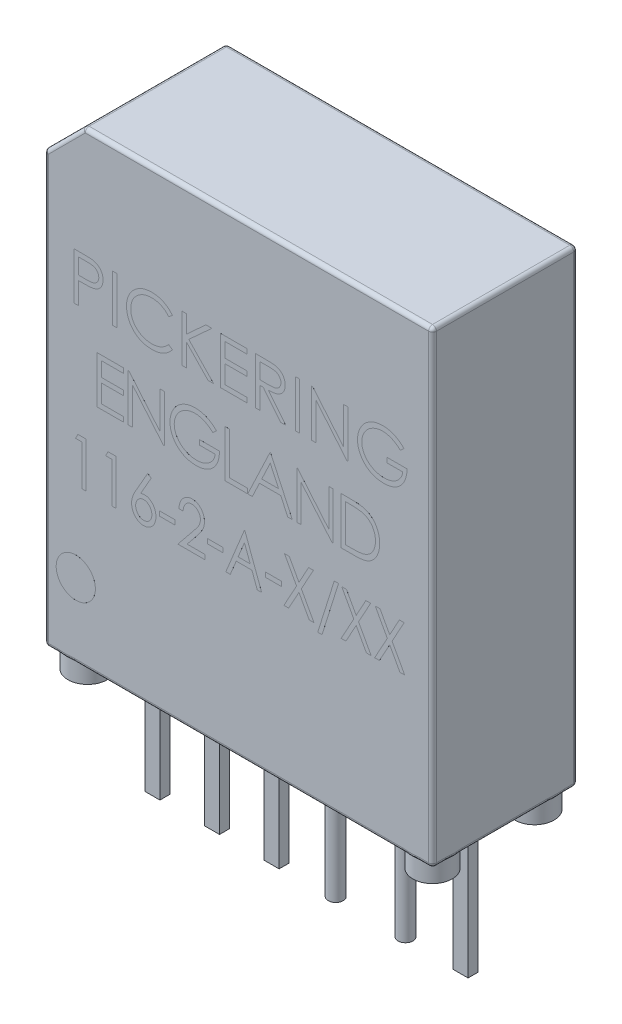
from build123d import *

# Parameters (mm, degrees)
SKETCH1_W           = 9.9
SKETCH1_H           = 3.7
MAIN_BODY_DEPTH     = 11.942
BOX_STYLE_CUT_DEPTH = 14.446332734
SKETCH3_R           = 0.5
FEET_DEPTH          = 0.508
SKETCH4_R           = 0.1905
SKETCH4_W           = 0.381
SKETCH4_H           = 0.254
PINS_DEPTH          = 3.678
SKETCH5_R           = 0.5
SKETCH5_W           = 0.107692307
SKETCH5_H           = 1.2
SKETCH5_W_2         = 0.107692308
SKETCH5_W_3         = 0.398076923
SKETCH5_H_2         = 0.117948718
LETTERING_DEPTH     = 0.0001
FILLET2_R           = 0.1


with BuildPart() as part:
    # Sketch1 → Main body (new body)
    with BuildSketch(Plane(origin=(0, 0, 0), x_dir=(1, 0, 0), z_dir=(0, 1, 0))):
        Rectangle(SKETCH1_W, SKETCH1_H)
    extrude(amount=MAIN_BODY_DEPTH)

    # Sketch2 → Box style cut (cut, through all)
    with BuildSketch(Plane.XY.offset(1.85)):
        Polygon((-3.95, 11.942), (-4.95, 10.942), (-4.95, 11.942), align=None)
    extrude(amount=-BOX_STYLE_CUT_DEPTH, mode=Mode.SUBTRACT)

    # Sketch3 → Feet (add)
    with BuildSketch(Plane.XZ):
        with Locations(Location((-4.4, 1.3, 0), (0, 0, 90))):
            Circle(SKETCH3_R)
        with Locations(Location((-4.4, -1.3, 0), (0, 0, 90))):
            Circle(SKETCH3_R)
        with Locations(Location((4.4, -1.3, 0), (0, 0, 90))):
            Circle(SKETCH3_R)
        with Locations(Location((4.4, 1.3, 0), (0, 0, 90))):
            Circle(SKETCH3_R)
    extrude(amount=FEET_DEPTH)

    # Sketch4 → Pins (add)
    with BuildSketch(Plane.XZ):
        with Locations(Location((2.41, 0, 0), (0, 0, 90))):
            Circle(SKETCH4_R)
        with Locations(Location((0.63, 0, 0), (0, 0, 90))):
            Circle(SKETCH4_R)
        with Locations((-3.93, -0.013013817)):
            Rectangle(SKETCH4_W, SKETCH4_H)
        with Locations((-2.41, -0.013013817)):
            Rectangle(SKETCH4_W, SKETCH4_H)
        with Locations((-0.89, -0.013013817)):
            Rectangle(SKETCH4_W, SKETCH4_H)
        with Locations((3.93, -0.013013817)):
            Rectangle(SKETCH4_W, SKETCH4_H)
    extrude(amount=PINS_DEPTH)

    # Sketch5 → Lettering (add)
    # profile 1 of 29: a face of its own
    with BuildSketch(Plane.XY.offset(1.85)):
        with Locations(Location((-4.15, 1.9, 0), (0, 0, 180))):
            Circle(SKETCH5_R)
    # profile 2 of 29: a face of its own
    with BuildSketch(Plane.XY.offset(1.85)):
        with BuildLine():
            Line((-4.193510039, 9.142), (-3.958173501, 9.142))
            add(Edge.make_bspline(
                [(-3.958173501, 9.142), (-3.941986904, 9.141982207), (-3.910972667, 9.141948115), (-3.866498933, 9.140914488), (-3.826107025, 9.139533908), (-3.789884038, 9.137620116), (-3.757718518, 9.135358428), (-3.729756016, 9.1321863), (-3.705776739, 9.128874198), (-3.691408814, 9.125506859), (-3.684856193, 9.123971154)],
                knots=[0, 0, 0, 0, 1.415646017, 2.712440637, 3.8905458, 4.950247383, 5.884950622, 6.709939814, 7.411656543, 8, 8, 8, 8], degree=3))
            add(Edge.make_bspline(
                [(-3.684856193, 9.123971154), (-3.676561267, 9.121700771), (-3.660166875, 9.117213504), (-3.63654366, 9.108225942), (-3.614068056, 9.097569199), (-3.59266295, 9.085423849), (-3.572591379, 9.071268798), (-3.553553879, 9.055677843), (-3.535718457, 9.03829102), (-3.519185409, 9.019303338), (-3.504002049, 8.999033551), (-3.490929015, 8.977179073), (-3.479982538, 8.954107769), (-3.470593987, 8.929835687), (-3.463836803, 8.904159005), (-3.458746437, 8.877256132), (-3.455515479, 8.849129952), (-3.45520603, 8.829909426), (-3.455048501, 8.820125)],
                knots=[0, 0, 0, 0, 0.999701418, 1.975846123, 2.934577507, 3.890451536, 4.834027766, 5.787354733, 6.749476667, 7.726910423, 8.712836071, 9.690891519, 10.682875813, 11.679750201, 12.712814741, 13.765529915, 14.8625177, 16, 16, 16, 16], degree=3))
            add(Edge.make_bspline(
                [(-3.455048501, 8.820125), (-3.455192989, 8.810258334), (-3.455475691, 8.790953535), (-3.458868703, 8.762711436), (-3.463439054, 8.735722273), (-3.470466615, 8.71004589), (-3.479670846, 8.685834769), (-3.490468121, 8.662718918), (-3.503491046, 8.641091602), (-3.518454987, 8.620874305), (-3.535101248, 8.602048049), (-3.553359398, 8.584749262), (-3.573155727, 8.569079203), (-3.594427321, 8.555002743), (-3.617381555, 8.542846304), (-3.641670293, 8.531958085), (-3.667504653, 8.522813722), (-3.685382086, 8.518003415), (-3.694471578, 8.515557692)],
                knots=[0, 0, 0, 0, 1.121902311, 2.195077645, 3.232258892, 4.234102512, 5.217864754, 6.176164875, 7.132989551, 8.084763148, 9.034132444, 9.988522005, 10.94243251, 11.903244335, 12.886203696, 13.894208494, 14.929344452, 16, 16, 16, 16], degree=3))
            add(Edge.make_bspline(
                [(-3.694471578, 8.515557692), (-3.701989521, 8.513958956), (-3.71846553, 8.510455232), (-3.745600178, 8.506543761), (-3.777192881, 8.503205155), (-3.81320052, 8.500701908), (-3.853590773, 8.498558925), (-3.89838549, 8.496855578), (-3.947672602, 8.495919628), (-3.982051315, 8.495871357), (-4.000000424, 8.495846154)],
                knots=[0, 0, 0, 0, 0.601384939, 1.31797006, 2.144135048, 3.087295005, 4.142315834, 5.309527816, 6.595305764, 8, 8, 8, 8], degree=3))
            Line((-4.000000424, 8.495846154), (-4.085817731, 8.495846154))
            Line((-4.085817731, 8.495846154), (-4.085817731, 7.942))
            Line((-4.085817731, 7.942), (-4.193510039, 7.942))
            Line((-4.193510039, 7.942), (-4.193510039, 9.142))
        make_face()
        with BuildLine():
            Line((-4.085817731, 9.018923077), (-4.085817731, 8.618923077))
            Line((-4.085817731, 8.618923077), (-3.875721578, 8.616278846))
            add(Edge.make_bspline(
                [(-3.875721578, 8.616278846), (-3.865463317, 8.616273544), (-3.845659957, 8.616263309), (-3.817053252, 8.617629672), (-3.790512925, 8.619206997), (-3.766120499, 8.621516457), (-3.743864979, 8.624780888), (-3.723709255, 8.628076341), (-3.705809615, 8.632843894), (-3.684861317, 8.639263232), (-3.661518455, 8.650211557), (-3.636123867, 8.666102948), (-3.614602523, 8.686359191), (-3.595979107, 8.709134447), (-3.581199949, 8.734471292), (-3.570380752, 8.761580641), (-3.564023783, 8.790184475), (-3.563171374, 8.809757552), (-3.562740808, 8.819644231)],
                knots=[0, 0, 0, 0, 1.160613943, 2.240541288, 3.23993089, 4.169200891, 5.011653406, 5.7853311, 6.478053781, 7.106038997, 8.262395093, 9.384106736, 10.481365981, 11.59014053, 12.70357646, 13.786202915, 14.881775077, 16, 16, 16, 16], degree=3))
            add(Edge.make_bspline(
                [(-3.562740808, 8.819644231), (-3.563173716, 8.829291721), (-3.564034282, 8.848469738), (-3.570430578, 8.876576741), (-3.581178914, 8.903400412), (-3.596078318, 8.928419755), (-3.614160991, 8.951113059), (-3.635177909, 8.97082636), (-3.659079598, 8.986673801), (-3.681313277, 8.996902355), (-3.701062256, 9.003147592), (-3.71821607, 9.007517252), (-3.737584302, 9.011006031), (-3.759173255, 9.013831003), (-3.782815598, 9.016249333), (-3.808714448, 9.017890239), (-3.836771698, 9.018850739), (-3.856249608, 9.01889838), (-3.866346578, 9.018923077)],
                knots=[0, 0, 0, 0, 1.120700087, 2.227813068, 3.331159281, 4.466773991, 5.599788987, 6.693661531, 7.80175334, 8.91857717, 9.525282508, 10.207424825, 10.974604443, 11.810962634, 12.737642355, 13.736264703, 14.826523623, 16, 16, 16, 16], degree=3))
            Line((-3.866346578, 9.018923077), (-4.085817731, 9.018923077))
        make_face(mode=Mode.SUBTRACT)
    # profile 3 of 29: a face of its own
    with BuildSketch(Plane.XY.offset(1.85)):
        with Locations((-3.155048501, 8.542)):
            Rectangle(SKETCH5_W, SKETCH5_H)
    # profile 4 of 29: a face of its own
    with BuildSketch(Plane.XY.offset(1.85)):
        with BuildLine():
            Line((-1.685817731, 8.921807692), (-1.780048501, 8.849692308))
            add(Edge.make_bspline(
                [(-1.780048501, 8.849692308), (-1.786770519, 8.857703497), (-1.80012393, 8.873617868), (-1.821607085, 8.895965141), (-1.84399622, 8.916901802), (-1.867282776, 8.936527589), (-1.891885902, 8.954156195), (-1.917209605, 8.970706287), (-1.943677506, 8.98554094), (-1.980278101, 9.00352825), (-2.028157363, 9.02229836), (-2.088429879, 9.038036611), (-2.15134797, 9.048055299), (-2.194272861, 9.049140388), (-2.216106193, 9.049692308)],
                knots=[0, 0, 0, 0, 0.757959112, 1.505699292, 2.245454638, 2.979532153, 3.711538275, 4.438200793, 5.171680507, 5.909471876, 7.393775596, 8.890124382, 10.418191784, 12, 12, 12, 12], degree=3))
            add(Edge.make_bspline(
                [(-2.216106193, 9.049692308), (-2.228134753, 9.049553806), (-2.252080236, 9.049278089), (-2.287616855, 9.045640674), (-2.322489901, 9.04052826), (-2.35667669, 9.032942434), (-2.390133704, 9.023351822), (-2.423079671, 9.01189168), (-2.455037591, 8.997712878), (-2.486449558, 8.982041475), (-2.516545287, 8.964340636), (-2.545021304, 8.945033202), (-2.57177375, 8.924335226), (-2.596823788, 8.902169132), (-2.620197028, 8.878634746), (-2.641724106, 8.853481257), (-2.661330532, 8.826789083), (-2.679404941, 8.798910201), (-2.695592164, 8.769925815), (-2.709145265, 8.739728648), (-2.721147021, 8.708835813), (-2.730643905, 8.676898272), (-2.738160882, 8.644140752), (-2.743347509, 8.610475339), (-2.746943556, 8.575972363), (-2.747217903, 8.552586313), (-2.747356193, 8.540798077)],
                knots=[0, 0, 0, 0, 1.054917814, 2.100044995, 3.131103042, 4.146048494, 5.169673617, 6.183595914, 7.203665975, 8.234915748, 9.262203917, 10.264457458, 11.251630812, 12.227803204, 13.197192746, 14.159520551, 15.12972552, 16.100847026, 17.073214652, 18.039054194, 19.002613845, 19.979014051, 20.95965708, 21.949030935, 22.966165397, 24, 24, 24, 24], degree=3))
            add(Edge.make_bspline(
                [(-2.747356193, 8.540798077), (-2.746923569, 8.523061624), (-2.74607417, 8.488238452), (-2.738514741, 8.437231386), (-2.727027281, 8.388367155), (-2.709810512, 8.341951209), (-2.688581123, 8.297411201), (-2.661755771, 8.255500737), (-2.630687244, 8.215586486), (-2.594936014, 8.178611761), (-2.555711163, 8.144835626), (-2.513626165, 8.11509257), (-2.468785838, 8.090298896), (-2.421685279, 8.069667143), (-2.37196204, 8.053807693), (-2.319705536, 8.042642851), (-2.265029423, 8.035359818), (-2.227668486, 8.034662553), (-2.20865427, 8.034307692)],
                knots=[0, 0, 0, 0, 1.029171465, 2.020641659, 2.987623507, 3.938342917, 4.889210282, 5.84687017, 6.821220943, 7.821438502, 8.827599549, 9.822697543, 10.807740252, 11.797342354, 12.80366471, 13.83203677, 14.896651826, 16, 16, 16, 16], degree=3))
            add(Edge.make_bspline(
                [(-2.20865427, 8.034307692), (-2.187704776, 8.034886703), (-2.146471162, 8.036026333), (-2.086002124, 8.045680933), (-2.028115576, 8.061335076), (-1.972808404, 8.083242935), (-1.920236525, 8.111722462), (-1.87031767, 8.146247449), (-1.823009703, 8.187146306), (-1.794562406, 8.218374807), (-1.780048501, 8.234307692)],
                knots=[0, 0, 0, 0, 1.028121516, 2.023589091, 2.998037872, 3.967518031, 4.937445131, 5.927275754, 6.942489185, 8, 8, 8, 8], degree=3))
            Line((-1.780048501, 8.234307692), (-1.685817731, 8.162913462))
            add(Edge.make_bspline(
                [(-1.685817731, 8.162913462), (-1.693401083, 8.153128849), (-1.708531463, 8.133606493), (-1.733031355, 8.106084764), (-1.758840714, 8.080197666), (-1.786151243, 8.05615391), (-1.814648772, 8.033472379), (-1.844844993, 8.012797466), (-1.876342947, 7.993840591), (-1.909035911, 7.976482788), (-1.94288915, 7.961082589), (-1.977862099, 7.94789844), (-2.013804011, 7.936541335), (-2.050716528, 7.927197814), (-2.088676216, 7.919904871), (-2.127546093, 7.915029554), (-2.16741005, 7.911689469), (-2.194304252, 7.911385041), (-2.207933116, 7.911230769)],
                knots=[0, 0, 0, 0, 0.986787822, 1.968848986, 2.935600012, 3.899624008, 4.868462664, 5.837806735, 6.815139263, 7.798259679, 8.787526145, 9.778297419, 10.776456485, 11.791383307, 12.812564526, 13.85620153, 14.913611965, 16, 16, 16, 16], degree=3))
            add(Edge.make_bspline(
                [(-2.207933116, 7.911230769), (-2.220839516, 7.911320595), (-2.246360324, 7.911498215), (-2.284039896, 7.91437553), (-2.320722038, 7.918301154), (-2.35630191, 7.924212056), (-2.390973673, 7.931187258), (-2.424423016, 7.940537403), (-2.456979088, 7.951011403), (-2.488511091, 7.963321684), (-2.519045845, 7.977212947), (-2.548484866, 7.99291291), (-2.576814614, 8.010289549), (-2.604313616, 8.028959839), (-2.630575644, 8.049523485), (-2.655828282, 8.071694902), (-2.680213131, 8.095399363), (-2.695299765, 8.112492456), (-2.702885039, 8.121086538)],
                knots=[0, 0, 0, 0, 1.114604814, 2.203992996, 3.262667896, 4.300477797, 5.318619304, 6.316056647, 7.298880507, 8.271930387, 9.238335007, 10.195173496, 11.151986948, 12.108099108, 13.064862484, 14.031167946, 15.010108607, 16, 16, 16, 16], degree=3))
            add(Edge.make_bspline(
                [(-2.702885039, 8.121086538), (-2.715034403, 8.136014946), (-2.739186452, 8.165691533), (-2.770086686, 8.213789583), (-2.796537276, 8.264007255), (-2.817923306, 8.316608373), (-2.834641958, 8.371474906), (-2.846224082, 8.428634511), (-2.853750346, 8.488033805), (-2.854611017, 8.52843499), (-2.855048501, 8.548971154)],
                knots=[0, 0, 0, 0, 0.994628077, 1.977248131, 2.950237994, 3.925870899, 4.908910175, 5.911660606, 6.938484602, 8, 8, 8, 8], degree=3))
            add(Edge.make_bspline(
                [(-2.855048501, 8.548971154), (-2.854515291, 8.570555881), (-2.853466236, 8.613022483), (-2.844553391, 8.675344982), (-2.830215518, 8.735054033), (-2.809850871, 8.792038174), (-2.784031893, 8.846597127), (-2.752137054, 8.898314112), (-2.714536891, 8.947519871), (-2.671526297, 8.993467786), (-2.624360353, 9.035481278), (-2.573851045, 9.072443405), (-2.520097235, 9.103203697), (-2.463691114, 9.128916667), (-2.404210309, 9.148680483), (-2.341781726, 9.162515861), (-2.276522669, 9.171127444), (-2.231998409, 9.172216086), (-2.209375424, 9.172769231)],
                knots=[0, 0, 0, 0, 1.032925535, 2.032216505, 3.007276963, 3.968222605, 4.92396291, 5.891752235, 6.871517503, 7.883894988, 8.900124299, 9.891468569, 10.874487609, 11.85992873, 12.854644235, 13.869047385, 14.917252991, 16, 16, 16, 16], degree=3))
            add(Edge.make_bspline(
                [(-2.209375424, 9.172769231), (-2.195587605, 9.172603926), (-2.168296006, 9.172276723), (-2.127923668, 9.169086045), (-2.088617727, 9.163767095), (-2.050351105, 9.156527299), (-2.012937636, 9.147541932), (-1.976663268, 9.135836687), (-1.941315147, 9.122452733), (-1.907116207, 9.107038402), (-1.874230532, 9.089735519), (-1.842668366, 9.070735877), (-1.812680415, 9.050063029), (-1.784055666, 9.027892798), (-1.757272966, 9.003756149), (-1.731571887, 8.978316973), (-1.707825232, 8.950842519), (-1.693166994, 8.931503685), (-1.685817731, 8.921807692)],
                knots=[0, 0, 0, 0, 1.096760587, 2.17092713, 3.219439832, 4.250915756, 5.268269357, 6.278326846, 7.281116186, 8.274029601, 9.260640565, 10.235837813, 11.203064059, 12.156899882, 13.114053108, 14.069676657, 15.032185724, 16, 16, 16, 16], degree=3))
        make_face()
    # profile 5 of 29: a face of its own
    with BuildSketch(Plane.XY.offset(1.85)):
        Polygon((-1.439663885, 9.142), (-1.331971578, 9.142), (-1.331971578, 8.685028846), (-0.831731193, 9.142), (-0.678125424, 9.142), (-1.267788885, 8.603538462), (-0.631971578, 7.942), (-0.775481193, 7.942), (-1.331971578, 8.521086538), (-1.331971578, 7.942), (-1.439663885, 7.942), align=None)
    # profile 6 of 29: a face of its own
    with BuildSketch(Plane.XY.offset(1.85)):
        Polygon((-0.455048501, 9.142), (0.221874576, 9.142), (0.221874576, 9.018923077), (-0.347356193, 9.018923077), (-0.347356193, 8.649692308), (0.221874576, 8.649692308), (0.221874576, 8.526615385), (-0.347356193, 8.526615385), (-0.347356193, 8.065076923), (0.221874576, 8.065076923), (0.221874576, 7.942), (-0.455048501, 7.942), align=None)
    # profile 7 of 29: a face of its own
    with BuildSketch(Plane.XY.offset(1.85)):
        with BuildLine():
            Line((0.437259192, 9.142), (0.677403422, 9.142))
            add(Edge.make_bspline(
                [(0.677403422, 9.142), (0.693428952, 9.141946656), (0.724199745, 9.14184423), (0.768282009, 9.141273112), (0.808337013, 9.13963619), (0.844343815, 9.138227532), (0.876301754, 9.135658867), (0.904308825, 9.133203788), (0.928236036, 9.129989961), (0.942720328, 9.127005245), (0.949278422, 9.125653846)],
                knots=[0, 0, 0, 0, 1.410062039, 2.707475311, 3.878576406, 4.937260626, 5.877586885, 6.699081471, 7.410979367, 8, 8, 8, 8], degree=3))
            add(Edge.make_bspline(
                [(0.949278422, 9.125653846), (0.958057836, 9.123484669), (0.975429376, 9.11919259), (1.000440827, 9.110120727), (1.024274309, 9.09962257), (1.046830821, 9.087292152), (1.067997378, 9.073037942), (1.087992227, 9.057106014), (1.1069061, 9.039583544), (1.123974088, 9.020028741), (1.140067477, 8.999513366), (1.15364072, 8.977329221), (1.165341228, 8.954130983), (1.174656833, 8.929682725), (1.182157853, 8.904221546), (1.187446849, 8.877516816), (1.190618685, 8.849690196), (1.190941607, 8.830710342), (1.191105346, 8.821086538)],
                knots=[0, 0, 0, 0, 1.027469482, 2.033020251, 3.019912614, 3.986113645, 4.951240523, 5.91722682, 6.890402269, 7.87763091, 8.8651537, 9.85103654, 10.82876324, 11.815024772, 12.821070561, 13.842952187, 14.906261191, 16, 16, 16, 16], degree=3))
            add(Edge.make_bspline(
                [(1.191105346, 8.821086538), (1.190601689, 8.80509736), (1.189618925, 8.773898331), (1.180456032, 8.728620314), (1.16544694, 8.686383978), (1.144764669, 8.647242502), (1.118426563, 8.611958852), (1.086772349, 8.580967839), (1.049784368, 8.555034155), (1.01535146, 8.537050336), (0.984935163, 8.525532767), (0.95989517, 8.517428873), (0.932580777, 8.511167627), (0.903253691, 8.505558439), (0.871791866, 8.501323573), (0.83827071, 8.498221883), (0.802666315, 8.496283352), (0.778207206, 8.495994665), (0.765624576, 8.495846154)],
                knots=[0, 0, 0, 0, 1.260483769, 2.459530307, 3.627416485, 4.787058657, 5.939039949, 7.08810263, 8.267026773, 9.491475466, 10.141966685, 10.831826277, 11.566392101, 12.351337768, 13.187381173, 14.07005841, 15.007169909, 16, 16, 16, 16], degree=3))
            Line((0.765624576, 8.495846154), (1.206489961, 7.942))
            Line((1.206489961, 7.942), (1.073316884, 7.942))
            Line((1.073316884, 7.942), (0.632451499, 8.495846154))
            Line((0.632451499, 8.495846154), (0.544951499, 8.495846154))
            Line((0.544951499, 8.495846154), (0.544951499, 7.942))
            Line((0.544951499, 7.942), (0.437259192, 7.942))
            Line((0.437259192, 7.942), (0.437259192, 9.142))
        make_face()
        with BuildLine():
            Line((0.544951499, 9.018923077), (0.544951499, 8.618923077))
            Line((0.544951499, 8.618923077), (0.764663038, 8.617240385))
            add(Edge.make_bspline(
                [(0.764663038, 8.617240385), (0.774921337, 8.617235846), (0.794804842, 8.61722705), (0.823570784, 8.618596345), (0.850354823, 8.620154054), (0.875054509, 8.622536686), (0.897680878, 8.62560734), (0.91822262, 8.629448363), (0.936713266, 8.633923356), (0.958278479, 8.640849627), (0.982359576, 8.651823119), (1.008530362, 8.667788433), (1.030816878, 8.687869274), (1.049645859, 8.710831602), (1.06477595, 8.736078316), (1.07544294, 8.763306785), (1.082211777, 8.791829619), (1.083010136, 8.811433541), (1.083413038, 8.821326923)],
                knots=[0, 0, 0, 0, 1.146690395, 2.22261258, 3.21895312, 4.145990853, 4.996080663, 5.770904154, 6.481378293, 7.121626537, 8.300444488, 9.431385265, 10.535395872, 11.636531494, 12.74115979, 13.810798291, 14.895190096, 16, 16, 16, 16], degree=3))
            add(Edge.make_bspline(
                [(1.083413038, 8.821326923), (1.083000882, 8.830977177), (1.08218414, 8.850100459), (1.07551599, 8.878096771), (1.064239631, 8.904519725), (1.049043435, 8.929261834), (1.030529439, 8.951720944), (1.008820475, 8.970937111), (0.984510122, 8.98679407), (0.961788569, 8.996927), (0.941479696, 9.003139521), (0.923846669, 9.007511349), (0.903922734, 9.011023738), (0.881611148, 9.013837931), (0.857007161, 9.016256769), (0.829986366, 9.01788595), (0.800728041, 9.018850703), (0.780449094, 9.018898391), (0.769951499, 9.018923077)],
                knots=[0, 0, 0, 0, 1.101028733, 2.181837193, 3.264309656, 4.369019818, 5.486613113, 6.575447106, 7.666700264, 8.788928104, 9.402425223, 10.0903467, 10.862060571, 11.710948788, 12.657782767, 13.684531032, 14.801375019, 16, 16, 16, 16], degree=3))
            Line((0.769951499, 9.018923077), (0.544951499, 9.018923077))
        make_face(mode=Mode.SUBTRACT)
    # profile 8 of 29: a face of its own
    with BuildSketch(Plane.XY.offset(1.85)):
        with Locations((1.506489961, 8.542)):
            Rectangle(SKETCH5_W_2, SKETCH5_H)
    # profile 9 of 29: a face of its own
    with BuildSketch(Plane.XY.offset(1.85)):
        Polygon((1.868028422, 7.942), (1.868028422, 9.142), (1.890624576, 9.142), (2.683413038, 8.197528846), (2.683413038, 9.142), (2.791105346, 9.142), (2.791105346, 7.942), (2.766586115, 7.942), (1.97572073, 8.884307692), (1.97572073, 7.942), align=None)
    # profile 10 of 29: a face of its own
    with BuildSketch(Plane.XY.offset(1.85)):
        with BuildLine():
            Line((4.221874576, 8.937192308), (4.129566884, 8.849692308))
            add(Edge.make_bspline(
                [(4.129566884, 8.849692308), (4.112863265, 8.865405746), (4.079854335, 8.896457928), (4.026039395, 8.936747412), (3.969891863, 8.971261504), (3.911704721, 8.999343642), (3.852918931, 9.021750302), (3.794314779, 9.037702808), (3.736493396, 9.047876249), (3.698036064, 9.049092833), (3.679086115, 9.049692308)],
                knots=[0, 0, 0, 0, 1.08915593, 2.152340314, 3.188132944, 4.216796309, 5.218260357, 6.173443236, 7.099959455, 8, 8, 8, 8], degree=3))
            add(Edge.make_bspline(
                [(3.679086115, 9.049692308), (3.667458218, 9.0495505), (3.644232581, 9.049267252), (3.609733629, 9.045652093), (3.575596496, 9.040452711), (3.541885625, 9.032929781), (3.508535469, 9.023395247), (3.475662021, 9.011468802), (3.443203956, 8.997564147), (3.411467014, 8.981497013), (3.380698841, 8.96384678), (3.351639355, 8.94428728), (3.324103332, 8.92344541), (3.298608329, 8.900799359), (3.275007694, 8.876554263), (3.252739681, 8.851161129), (3.232587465, 8.823926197), (3.21438478, 8.795350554), (3.198146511, 8.765936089), (3.183812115, 8.735965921), (3.171778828, 8.705539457), (3.162257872, 8.674618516), (3.15440279, 8.643442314), (3.148876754, 8.611794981), (3.145761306, 8.579642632), (3.14522241, 8.558112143), (3.144951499, 8.547288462)],
                knots=[0, 0, 0, 0, 1.02818874, 2.053710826, 3.065248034, 4.081641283, 5.106893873, 6.131558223, 7.173050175, 8.228653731, 9.27666206, 10.308777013, 11.325269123, 12.329503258, 13.32196095, 14.316845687, 15.314881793, 16.315733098, 17.311955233, 18.285320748, 19.252783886, 20.203351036, 21.145449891, 22.095197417, 23.042428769, 24, 24, 24, 24], degree=3))
            add(Edge.make_bspline(
                [(3.144951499, 8.547288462), (3.145210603, 8.536224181), (3.145728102, 8.514125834), (3.149040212, 8.481145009), (3.155187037, 8.448654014), (3.163404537, 8.416546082), (3.173683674, 8.384766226), (3.186497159, 8.353452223), (3.201673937, 8.322605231), (3.219240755, 8.292503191), (3.238504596, 8.263181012), (3.260085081, 8.235560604), (3.283008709, 8.209274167), (3.308110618, 8.184905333), (3.334585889, 8.161802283), (3.363225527, 8.140601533), (3.393466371, 8.120894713), (3.425354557, 8.102930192), (3.458544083, 8.086881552), (3.49257497, 8.072610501), (3.527555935, 8.060857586), (3.563303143, 8.051278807), (3.599773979, 8.043427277), (3.637153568, 8.038376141), (3.675167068, 8.034710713), (3.700791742, 8.034442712), (3.713701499, 8.034307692)],
                knots=[0, 0, 0, 0, 0.93586088, 1.869166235, 2.799637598, 3.729985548, 4.670839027, 5.622275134, 6.589130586, 7.576015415, 8.568469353, 9.55398029, 10.53834874, 11.515998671, 12.510579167, 13.508179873, 14.527009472, 15.561807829, 16.601455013, 17.643573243, 18.680854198, 19.719860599, 20.772568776, 21.833555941, 22.908541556, 24, 24, 24, 24], degree=3))
            add(Edge.make_bspline(
                [(3.713701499, 8.034307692), (3.72925979, 8.034632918), (3.759811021, 8.035271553), (3.804720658, 8.040243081), (3.84785314, 8.048007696), (3.889087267, 8.05937886), (3.928470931, 8.073882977), (3.966148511, 8.09136711), (4.001823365, 8.112501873), (4.035602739, 8.13635577), (4.066719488, 8.162932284), (4.094783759, 8.191610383), (4.119347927, 8.222250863), (4.14077811, 8.254673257), (4.158506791, 8.289145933), (4.173058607, 8.325499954), (4.184212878, 8.363751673), (4.188791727, 8.390183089), (4.191105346, 8.403538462)],
                knots=[0, 0, 0, 0, 1.13008108, 2.219097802, 3.278683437, 4.311054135, 5.322181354, 6.324827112, 7.324222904, 8.330512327, 9.32562643, 10.293043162, 11.24128371, 12.174520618, 13.111833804, 14.052305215, 15.015860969, 16, 16, 16, 16], degree=3))
            Line((4.191105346, 8.403538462), (3.791105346, 8.403538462))
            Line((3.791105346, 8.403538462), (3.791105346, 8.526615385))
            Line((3.791105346, 8.526615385), (4.298797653, 8.526615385))
            add(Edge.make_bspline(
                [(4.298797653, 8.526615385), (4.298212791, 8.503675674), (4.29706811, 8.458778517), (4.289038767, 8.393302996), (4.276073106, 8.331461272), (4.258360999, 8.273188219), (4.235432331, 8.218566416), (4.207533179, 8.167540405), (4.174217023, 8.120439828), (4.136670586, 8.07688017), (4.094533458, 8.03802444), (4.048944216, 8.003873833), (3.999827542, 7.975107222), (3.947229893, 7.951703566), (3.891323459, 7.933438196), (3.831978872, 7.920487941), (3.769276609, 7.912729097), (3.726304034, 7.911737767), (3.704326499, 7.911230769)],
                knots=[0, 0, 0, 0, 1.140356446, 2.231883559, 3.274166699, 4.278491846, 5.25512956, 6.21435461, 7.1637429, 8.11826594, 9.068280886, 10.0076534, 10.945064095, 11.891975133, 12.864533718, 13.863980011, 14.907571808, 16, 16, 16, 16], degree=3))
            add(Edge.make_bspline(
                [(3.704326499, 7.911230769), (3.690780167, 7.911425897), (3.664062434, 7.91181075), (3.624602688, 7.914545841), (3.586230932, 7.918756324), (3.548952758, 7.925114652), (3.51263104, 7.932902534), (3.477447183, 7.942875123), (3.443267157, 7.954418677), (3.410038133, 7.967548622), (3.378061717, 7.982761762), (3.347195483, 7.999667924), (3.317268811, 8.018179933), (3.288485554, 8.038617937), (3.260695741, 8.060829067), (3.234078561, 8.084857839), (3.208485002, 8.110630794), (3.192452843, 8.128932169), (3.184374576, 8.138153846)],
                knots=[0, 0, 0, 0, 1.107784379, 2.184907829, 3.233506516, 4.263428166, 5.276301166, 6.270063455, 7.25232949, 8.225834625, 9.190232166, 10.146266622, 11.1027726, 12.066435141, 13.031522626, 14.010570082, 14.99756817, 16, 16, 16, 16], degree=3))
            add(Edge.make_bspline(
                [(3.184374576, 8.138153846), (3.172653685, 8.152783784), (3.149406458, 8.181800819), (3.119482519, 8.228292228), (3.093973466, 8.276430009), (3.073275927, 8.326348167), (3.057114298, 8.378000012), (3.045523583, 8.43131954), (3.038732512, 8.486375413), (3.037754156, 8.523632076), (3.037259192, 8.542480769)],
                knots=[0, 0, 0, 0, 1.023165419, 2.029347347, 3.013907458, 3.994755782, 4.975994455, 5.96558838, 6.970761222, 8, 8, 8, 8], degree=3))
            add(Edge.make_bspline(
                [(3.037259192, 8.542480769), (3.037441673, 8.556594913), (3.037804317, 8.584643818), (3.042201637, 8.626286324), (3.048510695, 8.667189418), (3.057783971, 8.707319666), (3.069474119, 8.746703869), (3.084063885, 8.785360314), (3.101050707, 8.823311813), (3.120794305, 8.860297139), (3.14276612, 8.895825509), (3.16661191, 8.929753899), (3.192670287, 8.961464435), (3.220515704, 8.991358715), (3.250480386, 9.019061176), (3.282283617, 9.0448283), (3.315949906, 9.06869465), (3.351585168, 9.090284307), (3.388657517, 9.109677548), (3.427078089, 9.126679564), (3.466835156, 9.140730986), (3.507630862, 9.152653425), (3.549774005, 9.161470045), (3.592958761, 9.1678639), (3.637410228, 9.172238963), (3.667456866, 9.172590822), (3.682691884, 9.172769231)],
                knots=[0, 0, 0, 0, 1.008945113, 2.00506715, 2.99143336, 3.967273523, 4.948097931, 5.927297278, 6.919902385, 7.919676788, 8.923139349, 9.905703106, 10.883022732, 11.856032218, 12.825136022, 13.798837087, 14.781400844, 15.773989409, 16.776158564, 17.77167057, 18.775803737, 19.789618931, 20.80898985, 21.851988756, 22.910860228, 24, 24, 24, 24], degree=3))
            add(Edge.make_bspline(
                [(3.682691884, 9.172769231), (3.695116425, 9.172570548), (3.719752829, 9.172176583), (3.75641308, 9.169445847), (3.792506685, 9.165117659), (3.828087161, 9.159211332), (3.863033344, 9.151166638), (3.897444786, 9.141539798), (3.93137137, 9.130331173), (3.96470677, 9.116963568), (3.997675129, 9.101790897), (4.03045976, 9.084712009), (4.062948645, 9.065434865), (4.095198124, 9.043902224), (4.127411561, 9.020483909), (4.159079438, 8.994510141), (4.190966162, 8.967005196), (4.211469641, 8.947228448), (4.221874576, 8.937192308)],
                knots=[0, 0, 0, 0, 0.985871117, 1.954866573, 2.915460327, 3.869826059, 4.81536089, 5.759505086, 6.70452669, 7.649098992, 8.607881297, 9.583363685, 10.581137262, 11.603961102, 12.659522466, 13.73993555, 14.853081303, 16, 16, 16, 16], degree=3))
        make_face()
    # profile 11 of 29: a face of its own
    with BuildSketch(Plane.XY.offset(1.85)):
        Polygon((-3.604732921, 7.142), (-2.927809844, 7.142), (-2.927809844, 7.018923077), (-3.497040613, 7.018923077), (-3.497040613, 6.649692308), (-2.927809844, 6.649692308), (-2.927809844, 6.526615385), (-3.497040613, 6.526615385), (-3.497040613, 6.065076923), (-2.927809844, 6.065076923), (-2.927809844, 5.942), (-3.604732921, 5.942), align=None)
    # profile 12 of 29: a face of its own
    with BuildSketch(Plane.XY.offset(1.85)):
        Polygon((-2.81396369, 5.942), (-2.81396369, 7.142), (-2.791367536, 7.142), (-1.998579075, 6.197528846), (-1.998579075, 7.142), (-1.890886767, 7.142), (-1.890886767, 5.942), (-1.915405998, 5.942), (-2.706271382, 6.884307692), (-2.706271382, 5.942), align=None)
    # profile 13 of 29: a face of its own
    with BuildSketch(Plane.XY.offset(1.85)):
        with BuildLine():
            Line((-0.561655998, 6.937192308), (-0.65396369, 6.849692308))
            add(Edge.make_bspline(
                [(-0.65396369, 6.849692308), (-0.670667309, 6.865405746), (-0.703676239, 6.896457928), (-0.757491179, 6.936747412), (-0.813638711, 6.971261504), (-0.871825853, 6.999343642), (-0.930611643, 7.021750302), (-0.989215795, 7.037702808), (-1.047037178, 7.047876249), (-1.08549451, 7.049092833), (-1.104444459, 7.049692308)],
                knots=[0, 0, 0, 0, 1.08915593, 2.152340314, 3.188132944, 4.216796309, 5.218260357, 6.173443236, 7.099959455, 8, 8, 8, 8], degree=3))
            add(Edge.make_bspline(
                [(-1.104444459, 7.049692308), (-1.116072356, 7.0495505), (-1.139297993, 7.049267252), (-1.173796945, 7.045652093), (-1.207934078, 7.040452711), (-1.241644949, 7.032929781), (-1.274995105, 7.023395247), (-1.307868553, 7.011468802), (-1.340326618, 6.997564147), (-1.37206356, 6.981497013), (-1.402831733, 6.96384678), (-1.431891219, 6.94428728), (-1.459427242, 6.92344541), (-1.484922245, 6.900799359), (-1.50852288, 6.876554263), (-1.530790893, 6.851161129), (-1.550943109, 6.823926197), (-1.569145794, 6.795350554), (-1.585384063, 6.765936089), (-1.599718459, 6.735965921), (-1.611751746, 6.705539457), (-1.621272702, 6.674618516), (-1.629127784, 6.643442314), (-1.63465382, 6.611794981), (-1.637769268, 6.579642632), (-1.638308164, 6.558112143), (-1.638579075, 6.547288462)],
                knots=[0, 0, 0, 0, 1.02818874, 2.053710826, 3.065248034, 4.081641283, 5.106893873, 6.131558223, 7.173050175, 8.228653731, 9.27666206, 10.308777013, 11.325269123, 12.329503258, 13.32196095, 14.316845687, 15.314881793, 16.315733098, 17.311955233, 18.285320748, 19.252783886, 20.203351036, 21.145449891, 22.095197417, 23.042428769, 24, 24, 24, 24], degree=3))
            add(Edge.make_bspline(
                [(-1.638579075, 6.547288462), (-1.638319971, 6.536224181), (-1.637802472, 6.514125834), (-1.634490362, 6.481145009), (-1.628343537, 6.448654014), (-1.620126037, 6.416546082), (-1.6098469, 6.384766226), (-1.597033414, 6.353452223), (-1.581856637, 6.322605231), (-1.564289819, 6.292503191), (-1.545025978, 6.263181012), (-1.523445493, 6.235560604), (-1.500521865, 6.209274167), (-1.475419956, 6.184905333), (-1.448944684, 6.161802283), (-1.420305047, 6.140601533), (-1.390064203, 6.120894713), (-1.358176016, 6.102930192), (-1.324986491, 6.086881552), (-1.290955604, 6.072610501), (-1.255974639, 6.060857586), (-1.220227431, 6.051278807), (-1.183756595, 6.043427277), (-1.146377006, 6.038376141), (-1.108363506, 6.034710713), (-1.082738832, 6.034442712), (-1.069829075, 6.034307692)],
                knots=[0, 0, 0, 0, 0.93586088, 1.869166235, 2.799637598, 3.729985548, 4.670839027, 5.622275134, 6.589130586, 7.576015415, 8.568469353, 9.55398029, 10.53834874, 11.515998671, 12.510579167, 13.508179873, 14.527009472, 15.561807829, 16.601455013, 17.643573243, 18.680854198, 19.719860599, 20.772568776, 21.833555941, 22.908541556, 24, 24, 24, 24], degree=3))
            add(Edge.make_bspline(
                [(-1.069829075, 6.034307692), (-1.054270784, 6.034632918), (-1.023719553, 6.035271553), (-0.978809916, 6.040243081), (-0.935677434, 6.048007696), (-0.894443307, 6.05937886), (-0.855059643, 6.073882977), (-0.817382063, 6.09136711), (-0.781707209, 6.112501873), (-0.747927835, 6.13635577), (-0.716811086, 6.162932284), (-0.688746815, 6.191610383), (-0.664182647, 6.222250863), (-0.642752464, 6.254673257), (-0.625023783, 6.289145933), (-0.610471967, 6.325499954), (-0.599317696, 6.363751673), (-0.594738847, 6.390183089), (-0.592425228, 6.403538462)],
                knots=[0, 0, 0, 0, 1.13008108, 2.219097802, 3.278683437, 4.311054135, 5.322181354, 6.324827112, 7.324222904, 8.330512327, 9.32562643, 10.293043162, 11.24128371, 12.174520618, 13.111833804, 14.052305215, 15.015860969, 16, 16, 16, 16], degree=3))
            Line((-0.592425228, 6.403538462), (-0.992425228, 6.403538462))
            Line((-0.992425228, 6.403538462), (-0.992425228, 6.526615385))
            Line((-0.992425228, 6.526615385), (-0.484732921, 6.526615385))
            add(Edge.make_bspline(
                [(-0.484732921, 6.526615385), (-0.485317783, 6.503675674), (-0.486462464, 6.458778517), (-0.494491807, 6.393302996), (-0.507457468, 6.331461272), (-0.525169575, 6.273188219), (-0.548098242, 6.218566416), (-0.575997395, 6.167540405), (-0.609313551, 6.120439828), (-0.646859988, 6.07688017), (-0.688997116, 6.03802444), (-0.734586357, 6.003873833), (-0.783703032, 5.975107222), (-0.836300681, 5.951703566), (-0.892207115, 5.933438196), (-0.951551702, 5.920487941), (-1.014253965, 5.912729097), (-1.05722654, 5.911737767), (-1.079204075, 5.911230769)],
                knots=[0, 0, 0, 0, 1.140356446, 2.231883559, 3.274166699, 4.278491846, 5.25512956, 6.21435461, 7.1637429, 8.11826594, 9.068280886, 10.0076534, 10.945064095, 11.891975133, 12.864533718, 13.863980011, 14.907571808, 16, 16, 16, 16], degree=3))
            add(Edge.make_bspline(
                [(-1.079204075, 5.911230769), (-1.092750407, 5.911425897), (-1.11946814, 5.91181075), (-1.158927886, 5.914545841), (-1.197299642, 5.918756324), (-1.234577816, 5.925114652), (-1.270899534, 5.932902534), (-1.306083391, 5.942875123), (-1.340263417, 5.954418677), (-1.373492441, 5.967548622), (-1.405468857, 5.982761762), (-1.436335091, 5.999667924), (-1.466261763, 6.018179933), (-1.49504502, 6.038617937), (-1.522834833, 6.060829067), (-1.549452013, 6.084857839), (-1.575045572, 6.110630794), (-1.59107773, 6.128932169), (-1.599155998, 6.138153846)],
                knots=[0, 0, 0, 0, 1.107784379, 2.184907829, 3.233506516, 4.263428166, 5.276301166, 6.270063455, 7.25232949, 8.225834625, 9.190232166, 10.146266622, 11.1027726, 12.066435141, 13.031522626, 14.010570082, 14.99756817, 16, 16, 16, 16], degree=3))
            add(Edge.make_bspline(
                [(-1.599155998, 6.138153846), (-1.610876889, 6.152783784), (-1.634124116, 6.181800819), (-1.664048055, 6.228292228), (-1.689557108, 6.276430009), (-1.710254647, 6.326348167), (-1.726416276, 6.378000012), (-1.738006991, 6.43131954), (-1.744798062, 6.486375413), (-1.745776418, 6.523632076), (-1.746271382, 6.542480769)],
                knots=[0, 0, 0, 0, 1.023165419, 2.029347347, 3.013907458, 3.994755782, 4.975994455, 5.96558838, 6.970761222, 8, 8, 8, 8], degree=3))
            add(Edge.make_bspline(
                [(-1.746271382, 6.542480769), (-1.746088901, 6.556594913), (-1.745726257, 6.584643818), (-1.741328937, 6.626286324), (-1.735019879, 6.667189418), (-1.725746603, 6.707319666), (-1.714056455, 6.746703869), (-1.699466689, 6.785360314), (-1.682479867, 6.823311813), (-1.662736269, 6.860297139), (-1.640764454, 6.895825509), (-1.616918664, 6.929753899), (-1.590860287, 6.961464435), (-1.56301487, 6.991358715), (-1.533050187, 7.019061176), (-1.501246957, 7.0448283), (-1.467580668, 7.06869465), (-1.431945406, 7.090284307), (-1.394873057, 7.109677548), (-1.356452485, 7.126679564), (-1.316695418, 7.140730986), (-1.275899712, 7.152653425), (-1.233756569, 7.161470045), (-1.190571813, 7.1678639), (-1.146120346, 7.172238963), (-1.116073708, 7.172590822), (-1.10083869, 7.172769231)],
                knots=[0, 0, 0, 0, 1.008945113, 2.00506715, 2.99143336, 3.967273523, 4.948097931, 5.927297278, 6.919902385, 7.919676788, 8.923139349, 9.905703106, 10.883022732, 11.856032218, 12.825136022, 13.798837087, 14.781400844, 15.773989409, 16.776158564, 17.77167057, 18.775803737, 19.789618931, 20.80898985, 21.851988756, 22.910860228, 24, 24, 24, 24], degree=3))
            add(Edge.make_bspline(
                [(-1.10083869, 7.172769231), (-1.088414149, 7.172570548), (-1.063777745, 7.172176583), (-1.027117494, 7.169445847), (-0.991023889, 7.165117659), (-0.955443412, 7.159211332), (-0.92049723, 7.151166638), (-0.886085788, 7.141539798), (-0.852159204, 7.130331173), (-0.818823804, 7.116963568), (-0.785855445, 7.101790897), (-0.753070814, 7.084712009), (-0.720581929, 7.065434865), (-0.68833245, 7.043902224), (-0.656119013, 7.020483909), (-0.624451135, 6.994510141), (-0.592564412, 6.967005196), (-0.572060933, 6.947228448), (-0.561655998, 6.937192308)],
                knots=[0, 0, 0, 0, 0.985871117, 1.954866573, 2.915460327, 3.869826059, 4.81536089, 5.759505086, 6.70452669, 7.649098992, 8.607881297, 9.583363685, 10.581137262, 11.603961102, 12.659522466, 13.73993555, 14.853081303, 16, 16, 16, 16], degree=3))
        make_face()
    # profile 14 of 29: a face of its own
    with BuildSketch(Plane.XY.offset(1.85)):
        Polygon((-0.340117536, 7.142), (-0.232425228, 7.142), (-0.232425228, 6.065076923), (0.229113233, 6.065076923), (0.229113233, 5.942), (-0.340117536, 5.942), align=None)
    # profile 15 of 29: a face of its own
    with BuildSketch(Plane.XY.offset(1.85)):
        Polygon((0.819882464, 7.142), (1.373728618, 5.942), (1.25666131, 5.942), (1.079257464, 6.326615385), (0.535267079, 6.326615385), (0.352815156, 5.942), (0.235267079, 5.942), (0.804497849, 7.142), align=None)
        Polygon((0.810988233, 6.908105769), (0.593680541, 6.449692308), (1.022526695, 6.449692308), align=None, mode=Mode.SUBTRACT)
    # profile 16 of 29: a face of its own
    with BuildSketch(Plane.XY.offset(1.85)):
        Polygon((1.487574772, 5.942), (1.487574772, 7.142), (1.510170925, 7.142), (2.302959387, 6.197528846), (2.302959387, 7.142), (2.410651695, 7.142), (2.410651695, 5.942), (2.386132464, 5.942), (1.595267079, 6.884307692), (1.595267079, 5.942), align=None)
    # profile 17 of 29: a face of its own
    with BuildSketch(Plane.XY.offset(1.85)):
        with BuildLine():
            Line((2.616805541, 5.942), (2.616805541, 7.142))
            Line((2.616805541, 7.142), (2.859113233, 7.142))
            add(Edge.make_bspline(
                [(2.859113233, 7.142), (2.880188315, 7.141848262), (2.920905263, 7.141555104), (2.979743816, 7.139696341), (3.034183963, 7.136408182), (3.084046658, 7.13161863), (3.129468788, 7.12573759), (3.170323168, 7.118366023), (3.206821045, 7.109661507), (3.229267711, 7.10224021), (3.239882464, 7.098730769)],
                knots=[0, 0, 0, 0, 1.314313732, 2.53924729, 3.670748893, 4.714932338, 5.66265055, 6.526160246, 7.303039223, 8, 8, 8, 8], degree=3))
            add(Edge.make_bspline(
                [(3.239882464, 7.098730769), (3.253766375, 7.093440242), (3.281219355, 7.082979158), (3.320307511, 7.063245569), (3.357104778, 7.040886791), (3.391808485, 7.015873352), (3.423625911, 6.987497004), (3.453800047, 6.956963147), (3.481096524, 6.92316143), (3.506093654, 6.886792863), (3.528631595, 6.848285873), (3.548222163, 6.807713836), (3.564492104, 6.765282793), (3.577998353, 6.721110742), (3.588642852, 6.675100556), (3.595905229, 6.627198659), (3.600695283, 6.577594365), (3.601176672, 6.543934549), (3.601420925, 6.526855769)],
                knots=[0, 0, 0, 0, 0.984719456, 1.947108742, 2.898477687, 3.838006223, 4.779231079, 5.722358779, 6.681677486, 7.655904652, 8.64651281, 9.637519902, 10.640069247, 11.656948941, 12.698408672, 13.768548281, 14.867775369, 16, 16, 16, 16], degree=3))
            add(Edge.make_bspline(
                [(3.601420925, 6.526855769), (3.601205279, 6.512023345), (3.600780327, 6.482794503), (3.596964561, 6.439717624), (3.591418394, 6.397918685), (3.582831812, 6.357596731), (3.572408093, 6.318398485), (3.559048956, 6.280741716), (3.543745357, 6.244280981), (3.525899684, 6.209509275), (3.506308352, 6.176566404), (3.485283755, 6.145511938), (3.462848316, 6.116789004), (3.438788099, 6.090310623), (3.413414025, 6.066116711), (3.386559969, 6.044005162), (3.358156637, 6.024408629), (3.328331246, 6.006557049), (3.296213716, 5.990984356), (3.261195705, 5.977808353), (3.223127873, 5.966889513), (3.182103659, 5.957779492), (3.138052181, 5.950552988), (3.09093025, 5.945709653), (3.040810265, 5.942434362), (3.006394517, 5.942147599), (2.988680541, 5.942)],
                knots=[0, 0, 0, 0, 1.105936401, 2.179363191, 3.223086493, 4.248585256, 5.251745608, 6.245858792, 7.225916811, 8.198733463, 9.158002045, 10.082870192, 10.993790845, 11.873723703, 12.748670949, 13.606408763, 14.465103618, 15.319838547, 16.196477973, 17.123216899, 18.106603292, 19.147568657, 20.255746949, 21.433717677, 22.679120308, 24, 24, 24, 24], degree=3))
            Line((2.988680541, 5.942), (2.616805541, 5.942))
        make_face()
        with BuildLine():
            Line((2.724497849, 6.065076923), (2.862238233, 6.065076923))
            add(Edge.make_bspline(
                [(2.862238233, 6.065076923), (2.882030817, 6.065161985), (2.920099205, 6.065325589), (2.97483909, 6.066761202), (3.024854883, 6.069107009), (3.070153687, 6.072389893), (3.110709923, 6.076733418), (3.146608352, 6.081576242), (3.177731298, 6.087609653), (3.196564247, 6.093078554), (3.205267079, 6.095605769)],
                knots=[0, 0, 0, 0, 1.375205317, 2.645023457, 3.804390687, 4.853969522, 5.800190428, 6.637939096, 7.370582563, 8, 8, 8, 8], degree=3))
            add(Edge.make_bspline(
                [(3.205267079, 6.095605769), (3.216220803, 6.099463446), (3.237866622, 6.10708666), (3.269025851, 6.120992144), (3.298085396, 6.137463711), (3.32555169, 6.155773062), (3.351035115, 6.176565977), (3.374837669, 6.199390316), (3.39691143, 6.224362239), (3.417028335, 6.251450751), (3.435031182, 6.280487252), (3.450621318, 6.311186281), (3.4642847, 6.343211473), (3.475008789, 6.377054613), (3.483414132, 6.412413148), (3.48936774, 6.449289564), (3.493075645, 6.487676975), (3.493508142, 6.513786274), (3.493728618, 6.527096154)],
                knots=[0, 0, 0, 0, 0.998632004, 1.973411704, 2.929992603, 3.868527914, 4.809262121, 5.754881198, 6.702106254, 7.672490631, 8.653608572, 9.636854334, 10.631411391, 11.644891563, 12.686317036, 13.754757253, 14.855430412, 16, 16, 16, 16], degree=3))
            add(Edge.make_bspline(
                [(3.493728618, 6.527096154), (3.493552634, 6.54113049), (3.493206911, 6.568701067), (3.488861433, 6.60915502), (3.482511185, 6.648062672), (3.473328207, 6.685426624), (3.461626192, 6.721319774), (3.447022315, 6.755543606), (3.430336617, 6.788459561), (3.410484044, 6.819307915), (3.388741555, 6.848482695), (3.364611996, 6.875210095), (3.338478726, 6.899550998), (3.310626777, 6.921884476), (3.280271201, 6.941312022), (3.248127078, 6.958690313), (3.213722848, 6.973438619), (3.189787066, 6.9812828), (3.177622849, 6.985269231)],
                knots=[0, 0, 0, 0, 1.122418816, 2.205001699, 3.251619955, 4.274784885, 5.280384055, 6.268708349, 7.249350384, 8.229342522, 9.199999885, 10.157847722, 11.105861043, 12.055065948, 13.010012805, 13.98527497, 14.976112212, 16, 16, 16, 16], degree=3))
            add(Edge.make_bspline(
                [(3.177622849, 6.985269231), (3.167559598, 6.988052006), (3.146162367, 6.99396895), (3.11124598, 7.000423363), (3.071949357, 7.006116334), (3.028098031, 7.010936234), (2.979741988, 7.014394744), (2.926844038, 7.016990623), (2.869381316, 7.018741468), (2.829547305, 7.018861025), (2.808872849, 7.018923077)],
                knots=[0, 0, 0, 0, 0.674548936, 1.434276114, 2.292660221, 3.240891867, 4.284742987, 5.42552168, 6.663806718, 8, 8, 8, 8], degree=3))
            Line((2.808872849, 7.018923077), (2.724497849, 7.018923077))
            Line((2.724497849, 7.018923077), (2.724497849, 6.065076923))
        make_face(mode=Mode.SUBTRACT)
    # profile 18 of 29: a face of its own
    with BuildSketch(Plane.XY.offset(1.85)):
        Polygon((-4.093950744, 5.092), (-3.890304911, 5.092), (-3.890304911, 3.942), (-3.993510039, 3.942), (-3.993510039, 4.974051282), (-4.155689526, 4.974051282), align=None)
    # profile 19 of 29: a face of its own
    with BuildSketch(Plane.XY.offset(1.85)):
        Polygon((-3.327284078, 5.092), (-3.123638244, 5.092), (-3.123638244, 3.942), (-3.226843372, 3.942), (-3.226843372, 4.974051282), (-3.38902286, 4.974051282), align=None)
    # profile 20 of 29: a face of its own
    with BuildSketch(Plane.XY.offset(1.85)):
        with BuildLine():
            Line((-2.312740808, 5.121487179), (-2.227734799, 5.054910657))
            Line((-2.227734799, 5.054910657), (-2.492889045, 4.591409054))
            add(Edge.make_bspline(
                [(-2.492889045, 4.591409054), (-2.483929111, 4.593597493), (-2.466418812, 4.597874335), (-2.440322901, 4.602213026), (-2.415155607, 4.60484274), (-2.398674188, 4.605258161), (-2.390605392, 4.605461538)],
                knots=[0, 0, 0, 0, 1.069017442, 2.089168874, 3.064515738, 4, 4, 4, 4], degree=3))
            add(Edge.make_bspline(
                [(-2.390605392, 4.605461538), (-2.380911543, 4.605140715), (-2.361720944, 4.604505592), (-2.333586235, 4.599786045), (-2.306497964, 4.592170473), (-2.280631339, 4.581242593), (-2.255844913, 4.567315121), (-2.232154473, 4.550378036), (-2.209824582, 4.530158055), (-2.188748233, 4.507268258), (-2.169638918, 4.482027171), (-2.152353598, 4.4554244), (-2.138440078, 4.42697501), (-2.126417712, 4.397437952), (-2.117684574, 4.366162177), (-2.110759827, 4.333657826), (-2.107243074, 4.299609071), (-2.106638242, 4.276501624), (-2.106330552, 4.264746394)],
                knots=[0, 0, 0, 0, 0.94270807, 1.866248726, 2.767185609, 3.674541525, 4.590954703, 5.527962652, 6.501338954, 7.516419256, 8.550346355, 9.578210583, 10.597159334, 11.626461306, 12.676190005, 13.75154867, 14.856166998, 16, 16, 16, 16], degree=3))
            add(Edge.make_bspline(
                [(-2.106330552, 4.264746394), (-2.106792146, 4.2486647), (-2.107698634, 4.217083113), (-2.115578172, 4.171029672), (-2.127949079, 4.127174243), (-2.145672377, 4.086088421), (-2.167973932, 4.04817266), (-2.194757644, 4.014204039), (-2.225628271, 3.984143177), (-2.260535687, 3.958784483), (-2.298168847, 3.93828258), (-2.337729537, 3.923301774), (-2.378835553, 3.914285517), (-2.406764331, 3.913105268), (-2.420783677, 3.912512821)],
                knots=[0, 0, 0, 0, 1.100029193, 2.160261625, 3.188348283, 4.212531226, 5.214007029, 6.19084986, 7.16470451, 8.153968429, 9.134706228, 10.089452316, 11.040966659, 12, 12, 12, 12], degree=3))
            add(Edge.make_bspline(
                [(-2.420783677, 3.912512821), (-2.434343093, 3.913019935), (-2.461275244, 3.914027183), (-2.500823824, 3.922880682), (-2.538738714, 3.937405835), (-2.574916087, 3.957138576), (-2.608307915, 3.982327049), (-2.638310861, 4.012278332), (-2.664249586, 4.047059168), (-2.68615981, 4.085886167), (-2.7037967, 4.127619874), (-2.716211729, 4.17142773), (-2.724153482, 4.216540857), (-2.725089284, 4.247205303), (-2.725561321, 4.262673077)],
                knots=[0, 0, 0, 0, 0.944369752, 1.875737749, 2.809318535, 3.767620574, 4.738711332, 5.715334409, 6.713191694, 7.753677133, 8.816521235, 9.863637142, 10.922374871, 12, 12, 12, 12], degree=3))
            add(Edge.make_bspline(
                [(-2.725561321, 4.262673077), (-2.725220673, 4.274512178), (-2.724525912, 4.298658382), (-2.719717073, 4.335244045), (-2.712034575, 4.372713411), (-2.70130809, 4.411678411), (-2.686241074, 4.452934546), (-2.66633848, 4.497494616), (-2.64193589, 4.546103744), (-2.623054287, 4.579286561), (-2.613141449, 4.596707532)],
                knots=[0, 0, 0, 0, 0.796578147, 1.624645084, 2.47893077, 3.369018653, 4.341574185, 5.431288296, 6.651426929, 8, 8, 8, 8], degree=3))
            Line((-2.613141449, 4.596707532), (-2.312740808, 5.121487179))
        make_face()
        with BuildLine():
            add(Edge.make_bspline(
                [(-2.416176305, 4.487512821), (-2.423171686, 4.487250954), (-2.436994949, 4.48673349), (-2.457372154, 4.483844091), (-2.476817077, 4.478326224), (-2.495652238, 4.471343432), (-2.513474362, 4.461679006), (-2.530598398, 4.450100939), (-2.546996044, 4.436479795), (-2.562253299, 4.420887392), (-2.576305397, 4.403870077), (-2.588697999, 4.38578463), (-2.599225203, 4.366769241), (-2.607440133, 4.346752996), (-2.614204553, 4.325988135), (-2.619042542, 4.304324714), (-2.621848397, 4.281714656), (-2.622184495, 4.266366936), (-2.622356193, 4.258526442)],
                knots=[0, 0, 0, 0, 0.980440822, 1.937405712, 2.874327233, 3.807349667, 4.745813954, 5.706580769, 6.699688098, 7.726654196, 8.758342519, 9.787784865, 10.794031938, 11.796995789, 12.814224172, 13.850389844, 14.90185603, 16, 16, 16, 16], degree=3))
            add(Edge.make_bspline(
                [(-2.622356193, 4.258526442), (-2.622186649, 4.250762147), (-2.621854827, 4.23556632), (-2.619010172, 4.213118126), (-2.614252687, 4.19158629), (-2.607378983, 4.170936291), (-2.599294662, 4.151014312), (-2.588623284, 4.132154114), (-2.576315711, 4.114098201), (-2.562249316, 4.097091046), (-2.547001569, 4.081484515), (-2.530581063, 4.067907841), (-2.513508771, 4.056154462), (-2.495345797, 4.047035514), (-2.476655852, 4.039556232), (-2.457130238, 4.034157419), (-2.436767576, 4.031233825), (-2.422942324, 4.030721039), (-2.415945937, 4.030461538)],
                knots=[0, 0, 0, 0, 1.089616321, 2.132533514, 3.170816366, 4.179868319, 5.184881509, 6.183747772, 7.21529356, 8.249089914, 9.278154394, 10.273290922, 11.236020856, 12.180963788, 13.119799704, 14.05863562, 15.017555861, 16, 16, 16, 16], degree=3))
            add(Edge.make_bspline(
                [(-2.415945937, 4.030461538), (-2.408949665, 4.030721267), (-2.395124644, 4.031234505), (-2.3747603, 4.034154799), (-2.355240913, 4.039565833), (-2.336591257, 4.046974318), (-2.318572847, 4.056225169), (-2.301540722, 4.067902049), (-2.285105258, 4.081473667), (-2.26990331, 4.097177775), (-2.255528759, 4.113946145), (-2.243525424, 4.132230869), (-2.232866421, 4.151058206), (-2.224456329, 4.170881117), (-2.217657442, 4.191593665), (-2.212876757, 4.213116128), (-2.210038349, 4.235566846), (-2.209705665, 4.250762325), (-2.20953568, 4.258526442)],
                knots=[0, 0, 0, 0, 0.982721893, 1.941913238, 2.881014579, 3.820115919, 4.755744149, 5.718746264, 6.714164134, 7.743519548, 8.78450012, 9.810291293, 10.809439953, 11.81894996, 12.82828719, 13.866863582, 14.910075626, 16, 16, 16, 16], degree=3))
            add(Edge.make_bspline(
                [(-2.20953568, 4.258526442), (-2.209707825, 4.266366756), (-2.210044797, 4.281714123), (-2.212844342, 4.30432673), (-2.217705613, 4.325980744), (-2.224394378, 4.346808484), (-2.232936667, 4.366725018), (-2.243451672, 4.385707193), (-2.255539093, 4.404022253), (-2.269899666, 4.420799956), (-2.285109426, 4.436493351), (-2.301528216, 4.450097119), (-2.318646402, 4.461681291), (-2.336471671, 4.471338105), (-2.355369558, 4.478371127), (-2.374913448, 4.48380916), (-2.395355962, 4.486739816), (-2.409180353, 4.487253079), (-2.416176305, 4.487512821)],
                knots=[0, 0, 0, 0, 1.097086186, 2.147539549, 3.182707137, 4.198955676, 5.20515228, 6.210430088, 7.232854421, 8.270418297, 9.296395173, 10.288545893, 11.248387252, 12.185947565, 13.118071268, 14.064460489, 15.020503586, 16, 16, 16, 16], degree=3))
        make_face(mode=Mode.SUBTRACT)
    # profile 21 of 29: a face of its own
    with BuildSketch(Plane.XY.offset(1.85)):
        with Locations((-1.818830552, 4.384307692)):
            Rectangle(SKETCH5_W_3, SKETCH5_H_2)
    # profile 22 of 29: a face of its own
    with BuildSketch(Plane.XY.offset(1.85)):
        with BuildLine():
            Line((-1.413381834, 4.738153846), (-1.516586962, 4.738153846))
            add(Edge.make_bspline(
                [(-1.516586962, 4.738153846), (-1.515953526, 4.75184008), (-1.514710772, 4.778691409), (-1.509294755, 4.817886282), (-1.501386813, 4.855345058), (-1.489962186, 4.890711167), (-1.476148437, 4.924485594), (-1.459310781, 4.956260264), (-1.439619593, 4.986236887), (-1.417099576, 5.013883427), (-1.392680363, 5.039123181), (-1.366533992, 5.061279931), (-1.338730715, 5.079648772), (-1.309766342, 5.095174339), (-1.279207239, 5.106799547), (-1.247372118, 5.11547128), (-1.214052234, 5.120637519), (-1.191324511, 5.121201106), (-1.179788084, 5.121487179)],
                knots=[0, 0, 0, 0, 1.157388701, 2.270706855, 3.339969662, 4.388770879, 5.407173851, 6.420352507, 7.422937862, 8.433452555, 9.429357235, 10.387433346, 11.323406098, 12.240766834, 13.159137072, 14.080094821, 15.025470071, 16, 16, 16, 16], degree=3))
            add(Edge.make_bspline(
                [(-1.179788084, 5.121487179), (-1.168405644, 5.121192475), (-1.146147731, 5.120616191), (-1.113622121, 5.115658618), (-1.082844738, 5.107541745), (-1.053511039, 5.096542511), (-1.025968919, 5.081853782), (-1.000116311, 5.064042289), (-0.975848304, 5.043105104), (-0.953873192, 5.018955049), (-0.933685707, 4.992955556), (-0.916162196, 4.965358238), (-0.900998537, 4.936813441), (-0.889081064, 4.906849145), (-0.879612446, 4.875874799), (-0.872589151, 4.843774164), (-0.868717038, 4.810431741), (-0.868154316, 4.78784608), (-0.867869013, 4.776395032)],
                knots=[0, 0, 0, 0, 1.051800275, 2.056753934, 3.03304212, 3.990199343, 4.946039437, 5.910878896, 6.887218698, 7.901977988, 8.924307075, 9.926649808, 10.920510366, 11.907859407, 12.902632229, 13.912088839, 14.94141816, 16, 16, 16, 16], degree=3))
            add(Edge.make_bspline(
                [(-0.867869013, 4.776395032), (-0.868343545, 4.760238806), (-0.869282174, 4.728281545), (-0.877151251, 4.681216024), (-0.88987029, 4.635715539), (-0.904839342, 4.598819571), (-0.91999885, 4.568999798), (-0.9337847, 4.544725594), (-0.950091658, 4.518634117), (-0.968527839, 4.490471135), (-0.98941483, 4.460429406), (-1.012867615, 4.428612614), (-1.03833203, 4.394677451), (-1.0565601, 4.37174645), (-1.065986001, 4.359888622)],
                knots=[0, 0, 0, 0, 1.233482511, 2.439847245, 3.633928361, 4.836450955, 5.473897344, 6.188356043, 6.968050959, 7.823797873, 8.759406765, 9.762507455, 10.842972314, 12, 12, 12, 12], degree=3))
            Line((-1.065986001, 4.359888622), (-1.309715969, 4.059948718))
            Line((-1.309715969, 4.059948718), (-0.853125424, 4.059948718))
            Line((-0.853125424, 4.059948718), (-0.853125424, 3.942))
            Line((-0.853125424, 3.942), (-1.546074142, 3.942))
            Line((-1.546074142, 3.942), (-1.159515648, 4.417941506))
            add(Edge.make_bspline(
                [(-1.159515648, 4.417941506), (-1.150119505, 4.429283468), (-1.13204737, 4.451098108), (-1.106462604, 4.482883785), (-1.083437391, 4.512382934), (-1.062770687, 4.539477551), (-1.045182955, 4.564608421), (-1.029761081, 4.587206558), (-1.017111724, 4.607670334), (-1.003551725, 4.63171685), (-0.990591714, 4.661021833), (-0.979044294, 4.696540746), (-0.972503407, 4.733229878), (-0.97155335, 4.757941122), (-0.971074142, 4.770405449)],
                knots=[0, 0, 0, 0, 1.297809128, 2.496150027, 3.595226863, 4.595304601, 5.498308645, 6.297775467, 7.005697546, 7.617561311, 8.729167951, 9.822669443, 10.901756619, 12, 12, 12, 12], degree=3))
            add(Edge.make_bspline(
                [(-0.971074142, 4.770405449), (-0.971224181, 4.778248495), (-0.971519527, 4.793687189), (-0.974658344, 4.816345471), (-0.979499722, 4.838154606), (-0.986164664, 4.859254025), (-0.994911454, 4.879460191), (-1.005630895, 4.898832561), (-1.018414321, 4.917238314), (-1.032707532, 4.934834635), (-1.048531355, 4.950863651), (-1.065324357, 4.965057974), (-1.083195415, 4.976790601), (-1.101808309, 4.986655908), (-1.121364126, 4.994257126), (-1.141791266, 4.999500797), (-1.163013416, 5.002875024), (-1.177471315, 5.003314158), (-1.184856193, 5.003538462)],
                knots=[0, 0, 0, 0, 1.06989504, 2.106041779, 3.115552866, 4.11659498, 5.121251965, 6.115853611, 7.133385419, 8.176137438, 9.206329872, 10.203413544, 11.171427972, 12.118447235, 13.074126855, 14.027447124, 14.992449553, 16, 16, 16, 16], degree=3))
            add(Edge.make_bspline(
                [(-1.184856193, 5.003538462), (-1.192545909, 5.003303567), (-1.207686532, 5.002841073), (-1.229943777, 4.999585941), (-1.251179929, 4.994064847), (-1.27142913, 4.986297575), (-1.290839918, 4.976803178), (-1.308991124, 4.964482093), (-1.326247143, 4.950264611), (-1.342338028, 4.933864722), (-1.357153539, 4.915637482), (-1.37029144, 4.895462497), (-1.381850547, 4.873583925), (-1.391414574, 4.849810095), (-1.399935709, 4.824514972), (-1.405801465, 4.797190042), (-1.410922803, 4.768328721), (-1.41254784, 4.74838782), (-1.413381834, 4.738153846)],
                knots=[0, 0, 0, 0, 0.947670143, 1.865909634, 2.765819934, 3.646511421, 4.53540404, 5.422682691, 6.343698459, 7.287389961, 8.249693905, 9.234132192, 10.250229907, 11.294287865, 12.389763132, 13.535482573, 14.735172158, 16, 16, 16, 16], degree=3))
        make_face()
    # profile 23 of 29: a face of its own
    with BuildSketch(Plane.XY.offset(1.85)):
        with Locations((-0.595112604, 4.384307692)):
            Rectangle(SKETCH5_W_3, SKETCH5_H_2)
    # profile 24 of 29: a face of its own
    with BuildSketch(Plane.XY.offset(1.85)):
        Polygon((0.164182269, 5.092), (0.591746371, 3.942), (0.479787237, 3.942), (0.342948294, 4.310589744), (-0.057432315, 4.310589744), (-0.20855411, 3.942), (-0.322356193, 3.942), (0.149438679, 5.092), align=None)
        Polygon((0.152663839, 4.822238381), (-0.008824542, 4.428538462), (0.298947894, 4.428538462), align=None, mode=Mode.SUBTRACT)
    # profile 25 of 29: a face of its own
    with BuildSketch(Plane.XY.offset(1.85)):
        with Locations((0.893989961, 4.384307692)):
            Rectangle(SKETCH5_W_3, SKETCH5_H_2)
    # profile 26 of 29: a face of its own
    with BuildSketch(Plane.XY.offset(1.85)):
        Polygon((1.174118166, 5.092), (1.29598315, 5.092), (1.54270791, 4.641629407), (1.789432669, 5.092), (1.911297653, 5.092), (1.603755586, 4.530361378), (1.926041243, 3.942), (1.80394589, 3.942), (1.54270791, 4.419093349), (1.28123956, 3.942), (1.159374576, 3.942), (1.481660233, 4.530361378), align=None)
    # profile 27 of 29: a face of its own
    with BuildSketch(Plane.XY.offset(1.85)):
        Polygon((2.552643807, 5.121487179), (2.131530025, 3.779820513), (2.021874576, 3.779820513), (2.442988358, 5.121487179), align=None)
    # profile 28 of 29: a face of its own
    with BuildSketch(Plane.XY.offset(1.85)):
        Polygon((2.633733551, 5.092), (2.755598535, 5.092), (3.002323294, 4.641629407), (3.249048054, 5.092), (3.370913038, 5.092), (3.063370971, 4.530361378), (3.385656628, 3.942), (3.263561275, 3.942), (3.002323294, 4.419093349), (2.740854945, 3.942), (2.618989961, 3.942), (2.941275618, 4.530361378), align=None)
    # profile 29 of 29: a face of its own
    with BuildSketch(Plane.XY.offset(1.85)):
        Polygon((3.488861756, 5.092), (3.61072674, 5.092), (3.857451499, 4.641629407), (4.104176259, 5.092), (4.226041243, 5.092), (3.918499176, 4.530361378), (4.240784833, 3.942), (4.11868948, 3.942), (3.857451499, 4.419093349), (3.59598315, 3.942), (3.474118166, 3.942), (3.796403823, 4.530361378), align=None)
    extrude(amount=LETTERING_DEPTH)

    # Fillet2
    fillet2_edges = [part.edges().sort_by_distance(p)[0] for p in [
        (4.95, 11.942, 0),
        (0.5, 11.942, -1.85),
        (0.5, 11.942, 1.85),
        (-4.95, 5.471, -1.85),
        (-4.95, 5.471, 1.85),
        (-4.45, 11.442, -1.85),
        (-3.95, 11.942, 0),
        (-4.95, 10.942, 0),
        (-4.45, 11.442, 1.85),
        (0, 0, -1.85),
        (4.95, 0, 0),
        (0, 0, 1.85),
        (-4.95, 0, 0),
        (4.95, 5.971, -1.85),
        (4.95, 5.971, 1.85),
    ]]
    fillet(fillet2_edges, radius=FILLET2_R)


solid = part.part
